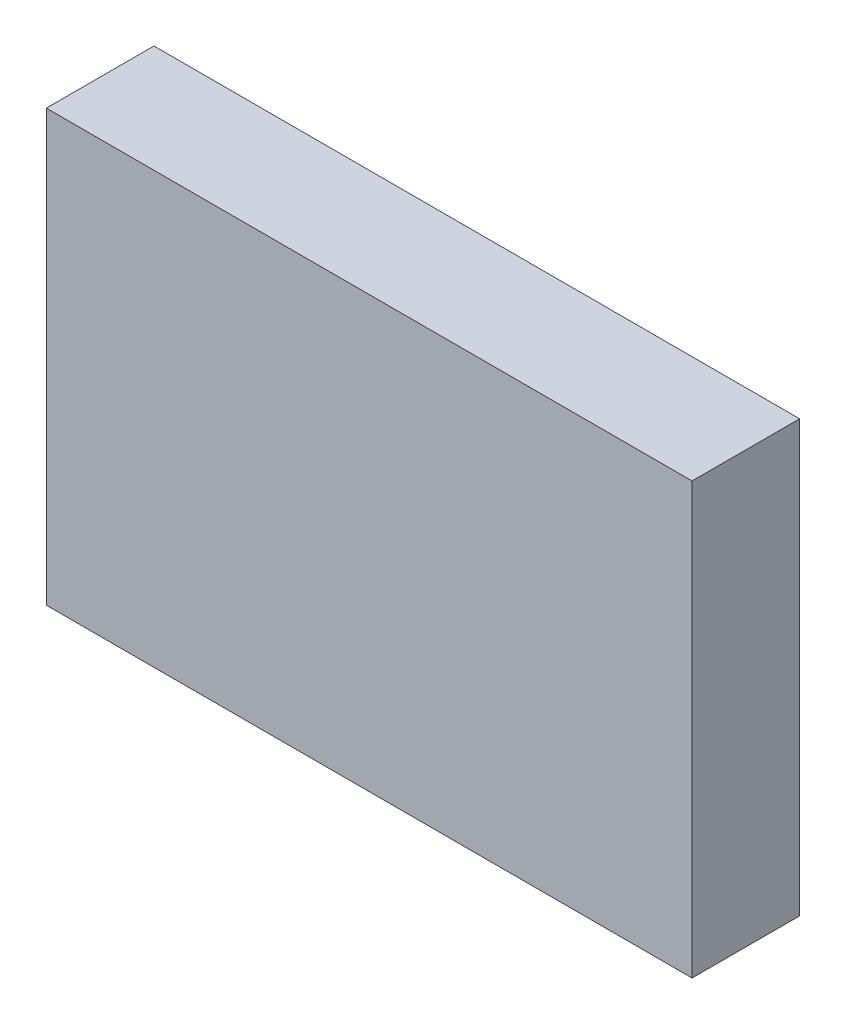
from build123d import *

# Parameters (mm, degrees)
SKETCH_1_W      = 300
SKETCH_1_H      = 200
EXTRUDE_1_DEPTH = 50


with BuildPart() as part:
    # Sketch 1 → Extrude 1 (new body)
    with BuildSketch(Plane.XY):
        Rectangle(SKETCH_1_W, SKETCH_1_H)
    extrude(amount=-EXTRUDE_1_DEPTH)


solid = part.part
